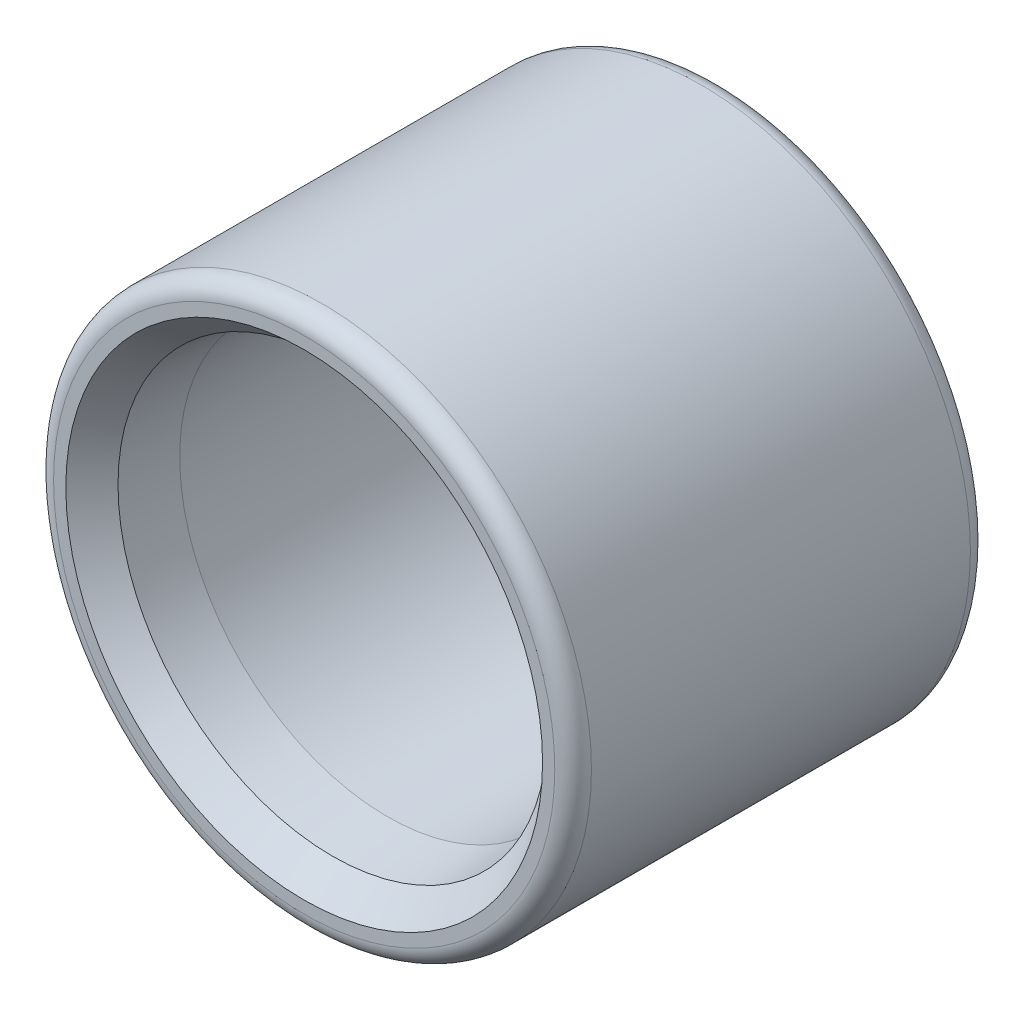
ISO-10303-21;
HEADER;
FILE_DESCRIPTION(('STEP AP214'),'2;1');
FILE_NAME('part.step','',(''),(''),'','','');
FILE_SCHEMA(('AUTOMOTIVE_DESIGN { 1 0 10303 214 1 1 1 1 }'));
ENDSEC;
DATA;
#1=APPLICATION_CONTEXT('core data for automotive mechanical design processes');
#2=APPLICATION_PROTOCOL_DEFINITION('international standard','automotive_design',2000,#1);
#3=PRODUCT_CONTEXT('',#1,'mechanical');
#4=PRODUCT('Part','Part','',(#3));
#5=PRODUCT_RELATED_PRODUCT_CATEGORY('part','',(#4));
#6=PRODUCT_DEFINITION_FORMATION('','',#4);
#7=PRODUCT_DEFINITION_CONTEXT('part definition',#1,'design');
#8=PRODUCT_DEFINITION('design','',#6,#7);
#9=PRODUCT_DEFINITION_SHAPE('','',#8);
#10=(LENGTH_UNIT() NAMED_UNIT(*) SI_UNIT(.MILLI.,.METRE.));
#11=(NAMED_UNIT(*) PLANE_ANGLE_UNIT() SI_UNIT($,.RADIAN.));
#12=(NAMED_UNIT(*) SI_UNIT($,.STERADIAN.) SOLID_ANGLE_UNIT());
#13=UNCERTAINTY_MEASURE_WITH_UNIT(LENGTH_MEASURE(1.E-05),#10,'distance_accuracy_value','');
#14=(GEOMETRIC_REPRESENTATION_CONTEXT(3) GLOBAL_UNCERTAINTY_ASSIGNED_CONTEXT((#13)) GLOBAL_UNIT_ASSIGNED_CONTEXT((#10,
#11,#12)) REPRESENTATION_CONTEXT('',''));
#15=CARTESIAN_POINT('',(0.,0.,0.));
#16=DIRECTION('',(0.,0.,1.));
#17=DIRECTION('',(1.,0.,0.));
#18=AXIS2_PLACEMENT_3D('',#15,#16,#17);
#19=CARTESIAN_POINT('',(0.,0.,26.9875));
#20=DIRECTION('',(0.,0.,1.));
#21=DIRECTION('',(1.,0.,0.));
#22=AXIS2_PLACEMENT_3D('',#19,#20,#21);
#23=PLANE('',#22);
#24=CARTESIAN_POINT('',(0.,0.,26.9875));
#25=DIRECTION('',(0.,0.,1.));
#26=DIRECTION('',(1.,0.,0.));
#27=AXIS2_PLACEMENT_3D('',#24,#25,#26);
#28=CIRCLE('',#27,32.54375);
#29=CARTESIAN_POINT('',(32.54375,0.,26.9875));
#30=VERTEX_POINT('',#29);
#31=EDGE_CURVE('E10',#30,#30,#28,.T.);
#32=ORIENTED_EDGE('',*,*,#31,.T.);
#33=EDGE_LOOP('',(#32));
#34=FACE_BOUND('',#33,.T.);
#35=CARTESIAN_POINT('',(0.,0.,26.9875));
#36=DIRECTION('',(0.,0.,1.));
#37=DIRECTION('',(1.,0.,0.));
#38=AXIS2_PLACEMENT_3D('',#35,#36,#37);
#39=CIRCLE('',#38,30.95625);
#40=CARTESIAN_POINT('',(30.95625,0.,26.9875));
#41=VERTEX_POINT('',#40);
#42=EDGE_CURVE('E60',#41,#41,#39,.T.);
#43=ORIENTED_EDGE('',*,*,#42,.F.);
#44=EDGE_LOOP('',(#43));
#45=FACE_BOUND('',#44,.T.);
#46=ADVANCED_FACE('F34',(#34,#45),#23,.T.);
#47=CARTESIAN_POINT('',(0.,0.,-26.9875));
#48=DIRECTION('',(0.,0.,1.));
#49=DIRECTION('',(1.,0.,0.));
#50=AXIS2_PLACEMENT_3D('',#47,#48,#49);
#51=PLANE('',#50);
#52=CARTESIAN_POINT('',(0.,0.,-26.9875));
#53=DIRECTION('',(0.,0.,1.));
#54=DIRECTION('',(1.,0.,0.));
#55=AXIS2_PLACEMENT_3D('',#52,#53,#54);
#56=CIRCLE('',#55,32.54375);
#57=CARTESIAN_POINT('',(32.54375,0.,-26.9875));
#58=VERTEX_POINT('',#57);
#59=EDGE_CURVE('E41',#58,#58,#56,.F.);
#60=ORIENTED_EDGE('',*,*,#59,.T.);
#61=EDGE_LOOP('',(#60));
#62=FACE_BOUND('',#61,.T.);
#63=CARTESIAN_POINT('',(0.,0.,-26.9875));
#64=DIRECTION('',(0.,0.,1.));
#65=DIRECTION('',(1.,0.,0.));
#66=AXIS2_PLACEMENT_3D('',#63,#64,#65);
#67=CIRCLE('',#66,30.95625);
#68=CARTESIAN_POINT('',(30.95625,0.,-26.9875));
#69=VERTEX_POINT('',#68);
#70=EDGE_CURVE('E66',#69,#69,#67,.T.);
#71=ORIENTED_EDGE('',*,*,#70,.T.);
#72=EDGE_LOOP('',(#71));
#73=FACE_BOUND('',#72,.T.);
#74=ADVANCED_FACE('F99',(#62,#73),#51,.F.);
#75=CARTESIAN_POINT('',(0.,0.,26.9875));
#76=DIRECTION('',(0.,0.,-1.));
#77=DIRECTION('',(-1.,0.,0.));
#78=AXIS2_PLACEMENT_3D('',#75,#76,#77);
#79=CYLINDRICAL_SURFACE('',#78,34.925);
#80=CARTESIAN_POINT('',(0.,0.,-24.60625));
#81=DIRECTION('',(0.,0.,1.));
#82=DIRECTION('',(1.,0.,0.));
#83=AXIS2_PLACEMENT_3D('',#80,#81,#82);
#84=CIRCLE('',#83,34.925);
#85=CARTESIAN_POINT('',(34.925,0.,-24.60625));
#86=VERTEX_POINT('',#85);
#87=EDGE_CURVE('E45',#86,#86,#84,.T.);
#88=ORIENTED_EDGE('',*,*,#87,.T.);
#89=EDGE_LOOP('',(#88));
#90=FACE_BOUND('',#89,.T.);
#91=CARTESIAN_POINT('',(0.,0.,24.60625));
#92=DIRECTION('',(0.,0.,1.));
#93=DIRECTION('',(1.,0.,0.));
#94=AXIS2_PLACEMENT_3D('',#91,#92,#93);
#95=CIRCLE('',#94,34.925);
#96=CARTESIAN_POINT('',(34.925,0.,24.60625));
#97=VERTEX_POINT('',#96);
#98=EDGE_CURVE('E49',#97,#97,#95,.F.);
#99=ORIENTED_EDGE('',*,*,#98,.T.);
#100=EDGE_LOOP('',(#99));
#101=FACE_BOUND('',#100,.T.);
#102=ADVANCED_FACE('F80',(#90,#101),#79,.T.);
#103=CARTESIAN_POINT('',(0.,0.,-16.1682125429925));
#104=DIRECTION('',(0.,0.,-1.));
#105=DIRECTION('',(-1.,0.,0.));
#106=AXIS2_PLACEMENT_3D('',#103,#104,#105);
#107=CONICAL_SURFACE('',#106,26.9875,0.122266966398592);
#108=CARTESIAN_POINT('',(0.,0.,-23.3024897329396));
#109=DIRECTION('',(0.,0.,1.));
#110=DIRECTION('',(1.,0.,0.));
#111=AXIS2_PLACEMENT_3D('',#108,#109,#110);
#112=CIRCLE('',#111,27.8641592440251);
#113=CARTESIAN_POINT('',(27.8641592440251,0.,-23.3024897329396));
#114=VERTEX_POINT('',#113);
#115=EDGE_CURVE('E69',#114,#114,#112,.T.);
#116=ORIENTED_EDGE('',*,*,#115,.F.);
#117=EDGE_LOOP('',(#116));
#118=FACE_BOUND('',#117,.T.);
#119=CARTESIAN_POINT('',(0.,0.,-16.1682125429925));
#120=DIRECTION('',(0.,0.,1.));
#121=DIRECTION('',(1.,0.,0.));
#122=AXIS2_PLACEMENT_3D('',#119,#120,#121);
#123=CIRCLE('',#122,26.9875);
#124=CARTESIAN_POINT('',(26.9875,0.,-16.1682125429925));
#125=VERTEX_POINT('',#124);
#126=EDGE_CURVE('E57',#125,#125,#123,.T.);
#127=ORIENTED_EDGE('',*,*,#126,.T.);
#128=EDGE_LOOP('',(#127));
#129=FACE_BOUND('',#128,.T.);
#130=ADVANCED_FACE('F76',(#118,#129),#107,.F.);
#131=CARTESIAN_POINT('',(0.,0.,26.9875));
#132=DIRECTION('',(0.,0.,1.));
#133=DIRECTION('',(1.,0.,0.));
#134=AXIS2_PLACEMENT_3D('',#131,#132,#133);
#135=CONICAL_SURFACE('',#134,28.3169729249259,0.122266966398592);
#136=CARTESIAN_POINT('',(0.,0.,23.3024897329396));
#137=DIRECTION('',(0.,0.,1.));
#138=DIRECTION('',(1.,0.,0.));
#139=AXIS2_PLACEMENT_3D('',#136,#137,#138);
#140=CIRCLE('',#139,27.8641592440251);
#141=CARTESIAN_POINT('',(27.8641592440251,0.,23.3024897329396));
#142=VERTEX_POINT('',#141);
#143=EDGE_CURVE('E63',#142,#142,#140,.T.);
#144=ORIENTED_EDGE('',*,*,#143,.T.);
#145=EDGE_LOOP('',(#144));
#146=FACE_BOUND('',#145,.T.);
#147=CARTESIAN_POINT('',(0.,0.,16.1682125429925));
#148=DIRECTION('',(0.,0.,1.));
#149=DIRECTION('',(1.,0.,0.));
#150=AXIS2_PLACEMENT_3D('',#147,#148,#149);
#151=CIRCLE('',#150,26.9875);
#152=CARTESIAN_POINT('',(26.9875,0.,16.1682125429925));
#153=VERTEX_POINT('',#152);
#154=EDGE_CURVE('E54',#153,#153,#151,.T.);
#155=ORIENTED_EDGE('',*,*,#154,.F.);
#156=EDGE_LOOP('',(#155));
#157=FACE_BOUND('',#156,.T.);
#158=ADVANCED_FACE('F79',(#146,#157),#135,.F.);
#159=CARTESIAN_POINT('',(0.,0.,26.9875));
#160=DIRECTION('',(0.,0.,-1.));
#161=DIRECTION('',(-1.,0.,0.));
#162=AXIS2_PLACEMENT_3D('',#159,#160,#161);
#163=CYLINDRICAL_SURFACE('',#162,26.9875);
#164=ORIENTED_EDGE('',*,*,#154,.T.);
#165=EDGE_LOOP('',(#164));
#166=FACE_BOUND('',#165,.T.);
#167=ORIENTED_EDGE('',*,*,#126,.F.);
#168=EDGE_LOOP('',(#167));
#169=FACE_BOUND('',#168,.T.);
#170=ADVANCED_FACE('F84',(#166,#169),#163,.F.);
#171=CARTESIAN_POINT('',(0.,0.,26.9875));
#172=DIRECTION('',(0.,0.,1.));
#173=DIRECTION('',(1.,0.,0.));
#174=AXIS2_PLACEMENT_3D('',#171,#172,#173);
#175=CONICAL_SURFACE('',#174,30.95625,0.698131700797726);
#176=ORIENTED_EDGE('',*,*,#143,.F.);
#177=EDGE_LOOP('',(#176));
#178=FACE_BOUND('',#177,.T.);
#179=ORIENTED_EDGE('',*,*,#42,.T.);
#180=EDGE_LOOP('',(#179));
#181=FACE_BOUND('',#180,.T.);
#182=ADVANCED_FACE('F86',(#178,#181),#175,.F.);
#183=CARTESIAN_POINT('',(0.,0.,-26.9875));
#184=DIRECTION('',(0.,0.,-1.));
#185=DIRECTION('',(1.,0.,0.));
#186=AXIS2_PLACEMENT_3D('',#183,#184,#185);
#187=CONICAL_SURFACE('',#186,30.95625,0.698131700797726);
#188=ORIENTED_EDGE('',*,*,#115,.T.);
#189=EDGE_LOOP('',(#188));
#190=FACE_BOUND('',#189,.T.);
#191=ORIENTED_EDGE('',*,*,#70,.F.);
#192=EDGE_LOOP('',(#191));
#193=FACE_BOUND('',#192,.T.);
#194=ADVANCED_FACE('F73',(#190,#193),#187,.F.);
#195=CARTESIAN_POINT('',(0.,0.,-24.60625));
#196=DIRECTION('',(0.,0.,1.));
#197=DIRECTION('',(1.,0.,0.));
#198=AXIS2_PLACEMENT_3D('',#195,#196,#197);
#199=TOROIDAL_SURFACE('',#198,32.54375,2.38125);
#200=ORIENTED_EDGE('',*,*,#59,.F.);
#201=EDGE_LOOP('',(#200));
#202=FACE_BOUND('',#201,.T.);
#203=ORIENTED_EDGE('',*,*,#87,.F.);
#204=EDGE_LOOP('',(#203));
#205=FACE_BOUND('',#204,.T.);
#206=ADVANCED_FACE('F108',(#202,#205),#199,.T.);
#207=CARTESIAN_POINT('',(0.,0.,24.60625));
#208=DIRECTION('',(0.,0.,1.));
#209=DIRECTION('',(1.,0.,0.));
#210=AXIS2_PLACEMENT_3D('',#207,#208,#209);
#211=TOROIDAL_SURFACE('',#210,32.54375,2.38125);
#212=ORIENTED_EDGE('',*,*,#98,.F.);
#213=EDGE_LOOP('',(#212));
#214=FACE_BOUND('',#213,.T.);
#215=ORIENTED_EDGE('',*,*,#31,.F.);
#216=EDGE_LOOP('',(#215));
#217=FACE_BOUND('',#216,.T.);
#218=ADVANCED_FACE('F36',(#214,#217),#211,.T.);
#219=CLOSED_SHELL('',(#46,#74,#102,#130,#158,#170,#182,#194,#206,#218));
#220=MANIFOLD_SOLID_BREP('B2',#219);
#221=ADVANCED_BREP_SHAPE_REPRESENTATION('',(#18,#220),#14);
#222=SHAPE_DEFINITION_REPRESENTATION(#9,#221);
ENDSEC;
END-ISO-10303-21;
